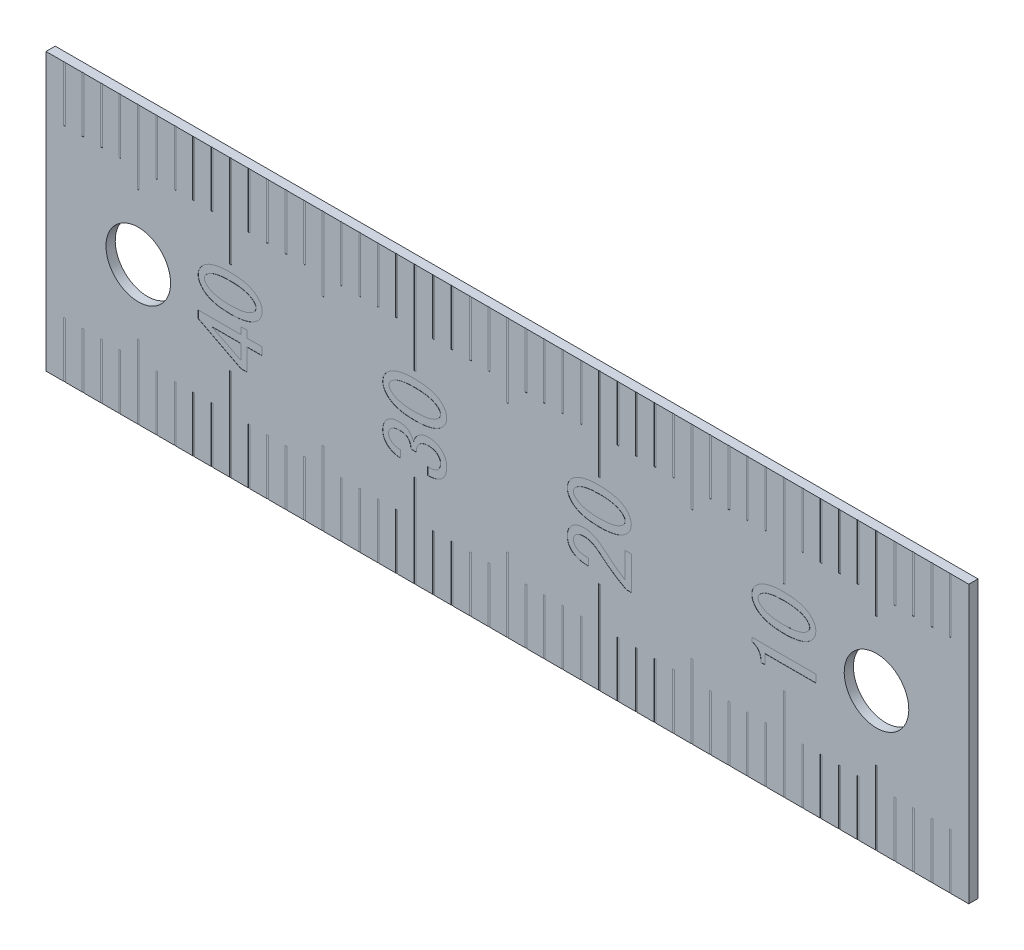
from build123d import *

# Parameters (mm, degrees)
SKETCH1_W             = 15
SKETCH1_H             = 50
EXTRUDE1_DEPTH        = 0.5
SKETCH2_R             = 1.75
EXTRUDE2_DEPTH        = 53.203927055
EXTRUDE3_DEPTH        = 0.01
SKETCH4_W             = 5
SKETCH4_H             = 0.1
SKETCH4_W_2           = 3
SKETCH4_W_3           = 4
EXTRUDE4_DEPTH        = 0.01
BODY_MOVE_COPY2_ANGLE = 90


with BuildPart() as part:
    # Sketch1 → Extrude1 (new body)
    with BuildSketch(Plane.XY):
        with Locations((7.5, 25)):
            Rectangle(SKETCH1_W, SKETCH1_H)
    extrude(amount=EXTRUDE1_DEPTH)

    # Sketch2 → Extrude2 (cut, through all)
    with BuildSketch(Plane.XY.offset(0.5)):
        with Locations((7.5, 5)):
            Circle(SKETCH2_R)
        with Locations((7.5, 45)):
            Circle(SKETCH2_R)
    extrude(amount=-EXTRUDE2_DEPTH, mode=Mode.SUBTRACT)

    # Sketch3 → Extrude3 (cut)
    # profile 1 of 8: a face of its own
    with BuildSketch(Plane.XY.offset(0.5)):
        Polygon((6.572881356, 38.286911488), (6.572881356, 38.694915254), (6.572881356, 39.105555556), (5.392372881, 39.105555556), (5.392372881, 39.442372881), (6.584745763, 41.755932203), (6.994067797, 41.755932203), (6.994067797, 39.442372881), (7.36779661, 39.442372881), (7.36779661, 39.105555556), (6.994067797, 39.105555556), (6.994067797, 38.286911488), align=None)
        Polygon((6.572881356, 39.442372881), (6.572881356, 41.008474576), (5.783898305, 39.442372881), align=None, mode=Mode.SUBTRACT)
    # profile 2 of 8: a face of its own
    with BuildSketch(Plane.XY.offset(0.5)):
        with BuildLine():
            add(Edge.make_bspline(
                [(7.670338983, 40.029661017), (7.670829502, 40.072507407), (7.671793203, 40.156685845), (7.676090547, 40.280686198), (7.684705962, 40.399825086), (7.696795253, 40.514071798), (7.710795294, 40.623684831), (7.729370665, 40.728309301), (7.751095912, 40.828149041), (7.77597959, 40.922993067), (7.804365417, 41.012966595), (7.836057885, 41.098089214), (7.870573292, 41.178755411), (7.909950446, 41.253817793), (7.951116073, 41.324637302), (7.996213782, 41.390336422), (8.044897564, 41.450979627), (8.080073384, 41.488323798), (8.097457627, 41.506779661)],
                knots=[0, 0, 0, 0, 1.305427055, 2.564715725, 3.779397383, 4.943659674, 6.064530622, 7.145206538, 8.1798118, 9.17670212, 10.131464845, 11.052792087, 11.943155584, 12.802378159, 13.633530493, 14.437472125, 15.227783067, 16, 16, 16, 16], degree=3))
            add(Edge.make_bspline(
                [(8.097457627, 41.506779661), (8.118189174, 41.526742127), (8.158560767, 41.565616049), (8.223990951, 41.6159742), (8.29062965, 41.658865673), (8.358609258, 41.695138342), (8.429073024, 41.722269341), (8.501187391, 41.741138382), (8.574673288, 41.753722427), (8.624274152, 41.755194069), (8.649152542, 41.755932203)],
                knots=[0, 0, 0, 0, 1.110117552, 2.161788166, 3.18031983, 4.16653166, 5.130321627, 6.086809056, 7.040397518, 8, 8, 8, 8], degree=3))
            add(Edge.make_bspline(
                [(8.649152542, 41.755932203), (8.674030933, 41.755194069), (8.723631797, 41.753722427), (8.797117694, 41.741138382), (8.869232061, 41.722269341), (8.939695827, 41.695138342), (9.007675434, 41.658865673), (9.074314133, 41.6159742), (9.139744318, 41.565616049), (9.18011591, 41.526742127), (9.200847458, 41.506779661)],
                knots=[0, 0, 0, 0, 0.959602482, 1.913190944, 2.869678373, 3.83346834, 4.81968017, 5.838211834, 6.889882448, 8, 8, 8, 8], degree=3))
            add(Edge.make_bspline(
                [(9.200847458, 41.506779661), (9.218227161, 41.488321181), (9.253393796, 41.450971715), (9.302148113, 41.39036917), (9.347032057, 41.324417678), (9.389280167, 41.254207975), (9.427522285, 41.17853116), (9.462317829, 41.098126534), (9.493918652, 41.012955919), (9.522335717, 40.922996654), (9.547189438, 40.828145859), (9.569006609, 40.728318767), (9.587229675, 40.623619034), (9.602638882, 40.514179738), (9.613279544, 40.399768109), (9.622305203, 40.280696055), (9.626487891, 40.156683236), (9.62746749, 40.072506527), (9.627966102, 40.029661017)],
                knots=[0, 0, 0, 0, 0.772188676, 1.562470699, 2.366382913, 3.20092084, 4.057056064, 4.947386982, 5.868680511, 6.823408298, 7.82026214, 8.854829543, 9.935465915, 11.057194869, 12.220740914, 13.435378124, 14.694620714, 16, 16, 16, 16], degree=3))
            add(Edge.make_bspline(
                [(9.627966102, 40.029661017), (9.627467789, 39.985936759), (9.62649093, 39.900222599), (9.622328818, 39.774232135), (9.613247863, 39.653405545), (9.602616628, 39.537241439), (9.587362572, 39.426237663), (9.568912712, 39.320259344), (9.547201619, 39.219315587), (9.522309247, 39.123160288), (9.494041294, 39.032051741), (9.462303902, 38.946046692), (9.427521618, 38.864982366), (9.389289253, 38.788641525), (9.347004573, 38.717800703), (9.302346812, 38.651238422), (9.253373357, 38.590568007), (9.218220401, 38.553208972), (9.200847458, 38.534745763)],
                knots=[0, 0, 0, 0, 1.317726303, 2.583183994, 3.797878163, 4.968595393, 6.097857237, 7.173314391, 8.20962062, 9.208490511, 10.165515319, 11.083041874, 11.969809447, 12.822581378, 13.653772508, 14.454446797, 15.23617212, 16, 16, 16, 16], degree=3))
            add(Edge.make_bspline(
                [(9.200847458, 38.534745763), (9.180085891, 38.515033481), (9.139553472, 38.476549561), (9.074305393, 38.426244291), (9.007859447, 38.383179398), (8.939507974, 38.347848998), (8.869256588, 38.320526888), (8.797111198, 38.30171788), (8.723633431, 38.289118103), (8.674031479, 38.287648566), (8.649152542, 38.286911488)],
                knots=[0, 0, 0, 0, 1.105704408, 2.15864601, 3.178408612, 4.161898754, 5.126853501, 6.084496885, 7.039237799, 8, 8, 8, 8], degree=3))
            add(Edge.make_bspline(
                [(8.649152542, 38.286911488), (8.624273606, 38.287648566), (8.574671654, 38.289118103), (8.501193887, 38.30171788), (8.429048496, 38.320526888), (8.358797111, 38.347848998), (8.290445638, 38.383179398), (8.223999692, 38.426244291), (8.158751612, 38.476549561), (8.118219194, 38.515033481), (8.097457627, 38.534745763)],
                knots=[0, 0, 0, 0, 0.960762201, 1.915503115, 2.873146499, 3.838101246, 4.821591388, 5.84135399, 6.894295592, 8, 8, 8, 8], degree=3))
            add(Edge.make_bspline(
                [(8.097457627, 38.534745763), (8.080080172, 38.553206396), (8.044918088, 38.590560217), (7.996014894, 38.65127076), (7.951141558, 38.717581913), (7.909944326, 38.789029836), (7.870572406, 38.864759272), (7.836072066, 38.946083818), (7.804242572, 39.032041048), (7.77600611, 39.123163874), (7.751083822, 39.219312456), (7.729463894, 39.320268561), (7.71066559, 39.426173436), (7.696818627, 39.537347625), (7.684739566, 39.65334975), (7.67606663, 39.77424179), (7.671790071, 39.900220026), (7.67082916, 39.98593589), (7.670338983, 40.029661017)],
                knots=[0, 0, 0, 0, 0.763855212, 1.545608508, 2.346311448, 3.174176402, 4.029980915, 4.916780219, 5.834339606, 6.79139866, 7.790304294, 8.826647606, 9.902143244, 11.030571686, 12.201985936, 13.416723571, 14.682226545, 16, 16, 16, 16], degree=3))
        make_face()
        with BuildLine():
            add(Edge.make_bspline(
                [(9.218644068, 40.029661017), (9.218401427, 40.06811401), (9.217925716, 40.143502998), (9.213890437, 40.254274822), (9.207394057, 40.36043931), (9.19820924, 40.461995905), (9.186467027, 40.558736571), (9.171997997, 40.650645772), (9.154788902, 40.737919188), (9.135417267, 40.820493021), (9.112729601, 40.898295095), (9.087786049, 40.971360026), (9.060527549, 41.040128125), (9.029099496, 41.103353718), (8.996371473, 41.162419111), (8.960630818, 41.216569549), (8.922584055, 41.266432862), (8.894393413, 41.296304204), (8.880508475, 41.311016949)],
                knots=[0, 0, 0, 0, 1.361121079, 2.668545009, 3.923107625, 5.125754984, 6.277561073, 7.372066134, 8.418398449, 9.425734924, 10.373324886, 11.2857946, 12.158104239, 12.989405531, 13.783340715, 14.546945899, 15.284316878, 16, 16, 16, 16], degree=3))
            add(Edge.make_bspline(
                [(8.880508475, 41.311016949), (8.862804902, 41.327301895), (8.828895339, 41.358494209), (8.771271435, 41.392758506), (8.711034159, 41.414027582), (8.669751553, 41.416541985), (8.649152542, 41.41779661)],
                knots=[0, 0, 0, 0, 1.101426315, 2.109680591, 3.056776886, 4, 4, 4, 4], degree=3))
            add(Edge.make_bspline(
                [(8.649152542, 41.41779661), (8.628553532, 41.416541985), (8.587270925, 41.414027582), (8.52703365, 41.392758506), (8.469409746, 41.358494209), (8.435500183, 41.327301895), (8.41779661, 41.311016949)],
                knots=[0, 0, 0, 0, 0.943223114, 1.890319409, 2.898573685, 4, 4, 4, 4], degree=3))
            add(Edge.make_bspline(
                [(8.41779661, 41.311016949), (8.403943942, 41.295612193), (8.375924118, 41.264452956), (8.337429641, 41.213183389), (8.302154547, 41.157195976), (8.269141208, 41.096778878), (8.238105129, 41.032500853), (8.210344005, 40.963298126), (8.185591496, 40.889711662), (8.163077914, 40.811655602), (8.143495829, 40.72935949), (8.126232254, 40.642529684), (8.111958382, 40.551250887), (8.100069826, 40.455410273), (8.090947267, 40.355384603), (8.084385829, 40.25076225), (8.080392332, 40.141745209), (8.07990761, 40.067454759), (8.079661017, 40.029661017)],
                knots=[0, 0, 0, 0, 0.733849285, 1.48435867, 2.268363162, 3.076728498, 3.92289974, 4.796109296, 5.716889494, 6.672935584, 7.673739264, 8.713513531, 9.809147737, 10.946688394, 12.135070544, 13.36761715, 14.660829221, 16, 16, 16, 16], degree=3))
            add(Edge.make_bspline(
                [(8.079661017, 40.029661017), (8.079901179, 39.99032918), (8.080370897, 39.913402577), (8.084420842, 39.800434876), (8.090885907, 39.692511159), (8.100090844, 39.589417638), (8.111903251, 39.491150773), (8.126256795, 39.397688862), (8.14342239, 39.309080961), (8.163018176, 39.225467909), (8.185450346, 39.146714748), (8.21053616, 39.072812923), (8.237777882, 39.003387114), (8.269201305, 38.93949489), (8.301960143, 38.879799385), (8.3374802, 38.825046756), (8.375740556, 38.775105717), (8.403918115, 38.745225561), (8.41779661, 38.730508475)],
                knots=[0, 0, 0, 0, 1.374671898, 2.688632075, 3.950368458, 5.153146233, 6.305673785, 7.409137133, 8.457347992, 9.459453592, 10.409852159, 11.318084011, 12.186518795, 13.014240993, 13.804868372, 14.565269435, 15.2933419, 16, 16, 16, 16], degree=3))
            add(Edge.make_bspline(
                [(8.41779661, 38.730508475), (8.43545363, 38.714135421), (8.469192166, 38.68285025), (8.527371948, 38.649736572), (8.587110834, 38.627272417), (8.628524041, 38.624907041), (8.649152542, 38.623728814)],
                knots=[0, 0, 0, 0, 1.101932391, 2.105541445, 3.0563435, 4, 4, 4, 4], degree=3))
            add(Edge.make_bspline(
                [(8.649152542, 38.623728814), (8.669781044, 38.624907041), (8.711194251, 38.627272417), (8.770933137, 38.649736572), (8.829112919, 38.68285025), (8.862851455, 38.714135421), (8.880508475, 38.730508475)],
                knots=[0, 0, 0, 0, 0.9436565, 1.894458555, 2.898067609, 4, 4, 4, 4], degree=3))
            add(Edge.make_bspline(
                [(8.880508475, 38.730508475), (8.894386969, 38.745225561), (8.922564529, 38.775105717), (8.960824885, 38.825046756), (8.996344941, 38.879799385), (9.02910378, 38.93949489), (9.060527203, 39.003387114), (9.087768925, 39.072812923), (9.112854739, 39.146714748), (9.135286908, 39.225467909), (9.154882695, 39.309080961), (9.17204829, 39.397688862), (9.186401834, 39.491150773), (9.198214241, 39.589417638), (9.207419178, 39.692511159), (9.213884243, 39.800434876), (9.217934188, 39.913402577), (9.218403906, 39.99032918), (9.218644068, 40.029661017)],
                knots=[0, 0, 0, 0, 0.7066581, 1.434730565, 2.195131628, 2.985759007, 3.813481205, 4.681915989, 5.590147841, 6.540546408, 7.542652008, 8.590862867, 9.694326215, 10.846853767, 12.049631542, 13.311367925, 14.625328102, 16, 16, 16, 16], degree=3))
        make_face(mode=Mode.SUBTRACT)
    # profile 3 of 8: a face of its own
    with BuildSketch(Plane.XY.offset(0.5)):
        with BuildLine():
            add(Edge.make_bspline(
                [(5.855084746, 29.31779661), (5.854237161, 29.286380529), (5.852594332, 29.225488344), (5.856876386, 29.137276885), (5.868367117, 29.055815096), (5.884283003, 28.980780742), (5.907291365, 28.912297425), (5.937126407, 28.851010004), (5.972049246, 28.795439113), (6.000912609, 28.763950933), (6.015254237, 28.748305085)],
                knots=[0, 0, 0, 0, 1.239207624, 2.401892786, 3.477811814, 4.480626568, 5.423235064, 6.318453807, 7.164473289, 8, 8, 8, 8], degree=3))
            add(Edge.make_bspline(
                [(6.015254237, 28.748305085), (6.037095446, 28.728932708), (6.081015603, 28.689977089), (6.162748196, 28.65151788), (6.254479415, 28.62775036), (6.319389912, 28.625111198), (6.353389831, 28.623728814)],
                knots=[0, 0, 0, 0, 0.943344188, 1.896956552, 2.898432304, 4, 4, 4, 4], degree=3))
            add(Edge.make_bspline(
                [(6.353389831, 28.623728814), (6.382885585, 28.625600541), (6.442770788, 28.629400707), (6.530035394, 28.662470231), (6.615193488, 28.713031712), (6.665308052, 28.759558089), (6.691525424, 28.783898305)],
                knots=[0, 0, 0, 0, 0.919697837, 1.867261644, 2.884260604, 4, 4, 4, 4], degree=3))
            add(Edge.make_bspline(
                [(6.691525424, 28.783898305), (6.704506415, 28.798041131), (6.730947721, 28.826849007), (6.762873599, 28.87803764), (6.790850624, 28.93489513), (6.812875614, 28.998785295), (6.830852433, 29.069052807), (6.842953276, 29.14607081), (6.850175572, 29.229773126), (6.851175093, 29.287680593), (6.851694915, 29.31779661)],
                knots=[0, 0, 0, 0, 0.805009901, 1.639744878, 2.523230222, 3.463349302, 4.47308559, 5.567268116, 6.734805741, 8, 8, 8, 8], degree=3))
            add(Edge.make_bspline(
                [(6.851694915, 29.31779661), (6.851030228, 29.341116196), (6.849720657, 29.387060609), (6.840325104, 29.454392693), (6.825098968, 29.518830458), (6.80407704, 29.580614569), (6.776099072, 29.639452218), (6.742223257, 29.695639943), (6.702890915, 29.749647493), (6.671713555, 29.781952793), (6.655932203, 29.798305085)],
                knots=[0, 0, 0, 0, 1.049658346, 2.068044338, 3.05411714, 4.026954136, 5.00039438, 5.980894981, 6.977969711, 8, 8, 8, 8], degree=3))
            add(Edge.make_bspline(
                [(6.655932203, 29.798305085), (6.643689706, 29.809635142), (6.618997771, 29.832486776), (6.576319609, 29.860786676), (6.529139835, 29.884057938), (6.477383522, 29.901482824), (6.421623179, 29.914983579), (6.361288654, 29.922371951), (6.296502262, 29.92600955), (6.251882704, 29.923947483), (6.228813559, 29.922881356)],
                knots=[0, 0, 0, 0, 0.871605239, 1.757943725, 2.667896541, 3.616736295, 4.609341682, 5.664478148, 6.79249158, 8, 8, 8, 8], degree=3))
            Line((6.228813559, 29.922881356), (6.228813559, 30.225423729))
            add(Edge.make_bspline(
                [(6.228813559, 30.225423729), (6.251905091, 30.227382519), (6.296701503, 30.231182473), (6.361634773, 30.240642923), (6.421607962, 30.255530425), (6.477699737, 30.27292487), (6.528907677, 30.295554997), (6.57613528, 30.321174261), (6.618876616, 30.350763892), (6.643673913, 30.374071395), (6.655932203, 30.38559322)],
                knots=[0, 0, 0, 0, 1.193010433, 2.314380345, 3.373317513, 4.371301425, 5.333718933, 6.249965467, 7.134888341, 8, 8, 8, 8], degree=3))
            add(Edge.make_bspline(
                [(6.655932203, 30.38559322), (6.667527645, 30.397801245), (6.691022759, 30.422537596), (6.719260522, 30.465783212), (6.744475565, 30.512503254), (6.7636149, 30.564151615), (6.779886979, 30.620003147), (6.790583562, 30.680329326), (6.797465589, 30.745099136), (6.798018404, 30.789622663), (6.798305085, 30.812711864)],
                knots=[0, 0, 0, 0, 0.872621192, 1.768137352, 2.671468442, 3.624922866, 4.621628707, 5.689026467, 6.801565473, 8, 8, 8, 8], degree=3))
            add(Edge.make_bspline(
                [(6.798305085, 30.812711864), (6.797772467, 30.841289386), (6.796742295, 30.896563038), (6.789606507, 30.97655192), (6.777306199, 31.050680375), (6.759528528, 31.118580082), (6.737339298, 31.180667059), (6.709321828, 31.236148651), (6.677557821, 31.286558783), (6.651119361, 31.314896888), (6.638135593, 31.328813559)],
                knots=[0, 0, 0, 0, 1.237773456, 2.394058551, 3.475172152, 4.488524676, 5.430883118, 6.32465486, 7.177248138, 8, 8, 8, 8], degree=3))
            add(Edge.make_bspline(
                [(6.638135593, 31.328813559), (6.619858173, 31.345254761), (6.583764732, 31.377722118), (6.518584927, 31.411756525), (6.44688644, 31.432032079), (6.396808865, 31.434387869), (6.371186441, 31.43559322)],
                knots=[0, 0, 0, 0, 0.996207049, 1.967265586, 2.959941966, 4, 4, 4, 4], degree=3))
            add(Edge.make_bspline(
                [(6.371186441, 31.43559322), (6.345564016, 31.434387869), (6.295486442, 31.432032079), (6.223787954, 31.411756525), (6.158608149, 31.377722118), (6.122514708, 31.345254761), (6.104237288, 31.328813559)],
                knots=[0, 0, 0, 0, 1.040058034, 2.032734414, 3.003792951, 4, 4, 4, 4], degree=3))
            add(Edge.make_bspline(
                [(6.104237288, 31.328813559), (6.089776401, 31.313325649), (6.060656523, 31.282137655), (6.023858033, 31.228720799), (5.99197489, 31.170117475), (5.965103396, 31.105788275), (5.942469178, 31.036012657), (5.926581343, 30.960375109), (5.914425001, 30.879600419), (5.910499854, 30.823738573), (5.908474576, 30.794915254)],
                knots=[0, 0, 0, 0, 0.873425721, 1.758816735, 2.667665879, 3.622477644, 4.631783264, 5.6899558, 6.808074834, 8, 8, 8, 8], degree=3))
            Line((5.908474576, 30.794915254), (5.516949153, 30.794915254))
            add(Edge.make_bspline(
                [(5.516949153, 30.794915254), (5.519136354, 30.832553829), (5.523428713, 30.906419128), (5.541152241, 31.014153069), (5.565742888, 31.116659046), (5.599421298, 31.213425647), (5.641988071, 31.304205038), (5.692307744, 31.389733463), (5.750770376, 31.470197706), (5.796519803, 31.518246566), (5.819491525, 31.542372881)],
                knots=[0, 0, 0, 0, 1.094560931, 2.148064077, 3.166651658, 4.153716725, 5.118829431, 6.07444051, 7.0331372, 8, 8, 8, 8], degree=3))
            add(Edge.make_bspline(
                [(5.819491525, 31.542372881), (5.837606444, 31.559463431), (5.873568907, 31.593392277), (5.933236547, 31.637089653), (5.997087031, 31.673081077), (6.063953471, 31.704293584), (6.135510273, 31.726605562), (6.210503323, 31.744361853), (6.289639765, 31.75403117), (6.343699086, 31.755291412), (6.371186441, 31.755932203)],
                knots=[0, 0, 0, 0, 0.982869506, 1.951232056, 2.911200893, 3.87414517, 4.85919522, 5.865267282, 6.914559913, 8, 8, 8, 8], degree=3))
            add(Edge.make_bspline(
                [(6.371186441, 31.755932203), (6.400212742, 31.75530941), (6.45690343, 31.754093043), (6.539734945, 31.744312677), (6.617668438, 31.726841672), (6.691695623, 31.704105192), (6.760787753, 31.673425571), (6.826107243, 31.637226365), (6.886527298, 31.593587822), (6.922581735, 31.559488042), (6.940677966, 31.542372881)],
                knots=[0, 0, 0, 0, 1.1148228, 2.177338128, 3.197095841, 4.179355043, 5.146818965, 6.095248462, 7.043978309, 8, 8, 8, 8], degree=3))
            add(Edge.make_bspline(
                [(6.940677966, 31.542372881), (6.960789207, 31.521311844), (7.000715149, 31.479500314), (7.050703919, 31.408467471), (7.093629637, 31.333157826), (7.129597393, 31.253229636), (7.156749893, 31.167830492), (7.175324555, 31.077438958), (7.187735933, 30.982230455), (7.189122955, 30.917115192), (7.189830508, 30.883898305)],
                knots=[0, 0, 0, 0, 0.965213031, 1.916194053, 2.872998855, 3.839092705, 4.81906353, 5.840080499, 6.898172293, 8, 8, 8, 8], degree=3))
            add(Edge.make_bspline(
                [(7.189830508, 30.883898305), (7.189188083, 30.853553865), (7.187942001, 30.794696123), (7.178630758, 30.709388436), (7.163534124, 30.62978595), (7.142688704, 30.555442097), (7.114814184, 30.48659326), (7.081194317, 30.423115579), (7.041799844, 30.364749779), (7.009934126, 30.331141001), (6.994067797, 30.31440678)],
                knots=[0, 0, 0, 0, 1.177909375, 2.284737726, 3.326967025, 4.320553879, 5.277281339, 6.204541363, 7.106019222, 8, 8, 8, 8], degree=3))
            add(Edge.make_bspline(
                [(6.994067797, 30.31440678), (6.965346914, 30.286806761), (6.910623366, 30.23421886), (6.82464357, 30.168038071), (6.741089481, 30.116155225), (6.683328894, 30.093701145), (6.655932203, 30.083050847)],
                knots=[0, 0, 0, 0, 1.156237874, 2.20304646, 3.147678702, 4, 4, 4, 4], degree=3))
            add(Edge.make_bspline(
                [(6.655932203, 30.083050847), (6.692456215, 30.070797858), (6.762638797, 30.04725317), (6.859251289, 30.002078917), (6.942516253, 29.949298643), (6.989290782, 29.907473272), (7.011864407, 29.887288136)],
                knots=[0, 0, 0, 0, 1.127022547, 2.165626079, 3.114721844, 4, 4, 4, 4], degree=3))
            add(Edge.make_bspline(
                [(7.011864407, 29.887288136), (7.031906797, 29.866396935), (7.071315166, 29.82531959), (7.121385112, 29.75713319), (7.164478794, 29.686384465), (7.200684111, 29.612307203), (7.227428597, 29.534251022), (7.246538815, 29.452987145), (7.258829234, 29.368703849), (7.26028238, 29.311247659), (7.261016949, 29.28220339)],
                knots=[0, 0, 0, 0, 1.032403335, 2.029964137, 3.011802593, 3.986915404, 4.966590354, 5.950024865, 6.963731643, 8, 8, 8, 8], degree=3))
            add(Edge.make_bspline(
                [(7.261016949, 29.28220339), (7.260107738, 29.244595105), (7.258326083, 29.170899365), (7.245030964, 29.062972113), (7.222782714, 28.960785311), (7.191569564, 28.864018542), (7.151384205, 28.772986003), (7.102175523, 28.687259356), (7.044331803, 28.606956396), (6.999018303, 28.558879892), (6.976271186, 28.534745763)],
                knots=[0, 0, 0, 0, 1.098385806, 2.152354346, 3.170785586, 4.14905217, 5.117394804, 6.071856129, 7.032082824, 8, 8, 8, 8], degree=3))
            add(Edge.make_bspline(
                [(6.976271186, 28.534745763), (6.95539303, 28.51489658), (6.913980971, 28.475525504), (6.844715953, 28.425961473), (6.772751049, 28.382434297), (6.69643541, 28.347443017), (6.616257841, 28.320218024), (6.532036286, 28.301445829), (6.444059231, 28.289024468), (6.383973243, 28.287624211), (6.353389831, 28.286911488)],
                knots=[0, 0, 0, 0, 1.002941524, 1.989345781, 2.961196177, 3.930871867, 4.909217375, 5.906794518, 6.934570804, 8, 8, 8, 8], degree=3))
            add(Edge.make_bspline(
                [(6.353389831, 28.286911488), (6.320174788, 28.287384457), (6.255300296, 28.288308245), (6.161021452, 28.300136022), (6.072206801, 28.31739535), (5.989040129, 28.342792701), (5.911092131, 28.374810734), (5.838829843, 28.414630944), (5.772044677, 28.461543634), (5.732521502, 28.498450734), (5.712711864, 28.516949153)],
                knots=[0, 0, 0, 0, 1.139704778, 2.226032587, 3.257187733, 4.242744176, 5.206582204, 6.145174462, 7.070332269, 8, 8, 8, 8], degree=3))
            add(Edge.make_bspline(
                [(5.712711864, 28.516949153), (5.691201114, 28.540157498), (5.64795465, 28.586816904), (5.593991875, 28.667318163), (5.547688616, 28.755199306), (5.509997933, 28.851612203), (5.481332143, 28.9564097), (5.460323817, 29.069484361), (5.447736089, 29.190956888), (5.44643317, 29.27470259), (5.445762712, 29.31779661)],
                knots=[0, 0, 0, 0, 0.875500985, 1.760158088, 2.674977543, 3.623303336, 4.621607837, 5.680513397, 6.806434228, 8, 8, 8, 8], degree=3))
            Line((5.445762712, 29.31779661), (5.855084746, 29.31779661))
        make_face()
    # profile 4 of 8: a face of its own
    with BuildSketch(Plane.XY.offset(0.5)):
        with BuildLine():
            add(Edge.make_bspline(
                [(7.670338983, 30.029661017), (7.670829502, 30.072507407), (7.671793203, 30.156685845), (7.676090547, 30.280686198), (7.684705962, 30.399825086), (7.696795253, 30.514071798), (7.710795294, 30.623684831), (7.729370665, 30.728309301), (7.751095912, 30.828149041), (7.77597959, 30.922993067), (7.804365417, 31.012966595), (7.836057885, 31.098089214), (7.870573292, 31.178755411), (7.909950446, 31.253817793), (7.951116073, 31.324637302), (7.996213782, 31.390336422), (8.044897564, 31.450979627), (8.080073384, 31.488323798), (8.097457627, 31.506779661)],
                knots=[0, 0, 0, 0, 1.305427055, 2.564715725, 3.779397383, 4.943659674, 6.064530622, 7.145206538, 8.1798118, 9.17670212, 10.131464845, 11.052792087, 11.943155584, 12.802378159, 13.633530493, 14.437472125, 15.227783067, 16, 16, 16, 16], degree=3))
            add(Edge.make_bspline(
                [(8.097457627, 31.506779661), (8.118189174, 31.526742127), (8.158560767, 31.565616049), (8.223990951, 31.6159742), (8.29062965, 31.658865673), (8.358609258, 31.695138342), (8.429073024, 31.722269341), (8.501187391, 31.741138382), (8.574673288, 31.753722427), (8.624274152, 31.755194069), (8.649152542, 31.755932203)],
                knots=[0, 0, 0, 0, 1.110117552, 2.161788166, 3.18031983, 4.16653166, 5.130321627, 6.086809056, 7.040397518, 8, 8, 8, 8], degree=3))
            add(Edge.make_bspline(
                [(8.649152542, 31.755932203), (8.674030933, 31.755194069), (8.723631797, 31.753722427), (8.797117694, 31.741138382), (8.869232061, 31.722269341), (8.939695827, 31.695138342), (9.007675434, 31.658865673), (9.074314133, 31.6159742), (9.139744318, 31.565616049), (9.18011591, 31.526742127), (9.200847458, 31.506779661)],
                knots=[0, 0, 0, 0, 0.959602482, 1.913190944, 2.869678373, 3.83346834, 4.81968017, 5.838211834, 6.889882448, 8, 8, 8, 8], degree=3))
            add(Edge.make_bspline(
                [(9.200847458, 31.506779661), (9.218227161, 31.488321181), (9.253393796, 31.450971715), (9.302148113, 31.39036917), (9.347032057, 31.324417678), (9.389280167, 31.254207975), (9.427522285, 31.17853116), (9.462317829, 31.098126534), (9.493918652, 31.012955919), (9.522335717, 30.922996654), (9.547189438, 30.828145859), (9.569006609, 30.728318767), (9.587229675, 30.623619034), (9.602638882, 30.514179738), (9.613279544, 30.399768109), (9.622305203, 30.280696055), (9.626487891, 30.156683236), (9.62746749, 30.072506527), (9.627966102, 30.029661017)],
                knots=[0, 0, 0, 0, 0.772188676, 1.562470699, 2.366382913, 3.20092084, 4.057056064, 4.947386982, 5.868680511, 6.823408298, 7.82026214, 8.854829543, 9.935465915, 11.057194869, 12.220740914, 13.435378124, 14.694620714, 16, 16, 16, 16], degree=3))
            add(Edge.make_bspline(
                [(9.627966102, 30.029661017), (9.627467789, 29.985936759), (9.62649093, 29.900222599), (9.622328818, 29.774232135), (9.613247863, 29.653405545), (9.602616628, 29.537241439), (9.587362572, 29.426237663), (9.568912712, 29.320259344), (9.547201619, 29.219315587), (9.522309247, 29.123160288), (9.494041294, 29.032051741), (9.462303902, 28.946046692), (9.427521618, 28.864982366), (9.389289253, 28.788641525), (9.347004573, 28.717800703), (9.302346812, 28.651238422), (9.253373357, 28.590568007), (9.218220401, 28.553208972), (9.200847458, 28.534745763)],
                knots=[0, 0, 0, 0, 1.317726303, 2.583183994, 3.797878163, 4.968595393, 6.097857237, 7.173314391, 8.20962062, 9.208490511, 10.165515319, 11.083041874, 11.969809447, 12.822581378, 13.653772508, 14.454446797, 15.23617212, 16, 16, 16, 16], degree=3))
            add(Edge.make_bspline(
                [(9.200847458, 28.534745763), (9.180085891, 28.515033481), (9.139553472, 28.476549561), (9.074305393, 28.426244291), (9.007859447, 28.383179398), (8.939507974, 28.347848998), (8.869256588, 28.320526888), (8.797111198, 28.30171788), (8.723633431, 28.289118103), (8.674031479, 28.287648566), (8.649152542, 28.286911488)],
                knots=[0, 0, 0, 0, 1.105704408, 2.15864601, 3.178408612, 4.161898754, 5.126853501, 6.084496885, 7.039237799, 8, 8, 8, 8], degree=3))
            add(Edge.make_bspline(
                [(8.649152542, 28.286911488), (8.624273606, 28.287648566), (8.574671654, 28.289118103), (8.501193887, 28.30171788), (8.429048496, 28.320526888), (8.358797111, 28.347848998), (8.290445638, 28.383179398), (8.223999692, 28.426244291), (8.158751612, 28.476549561), (8.118219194, 28.515033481), (8.097457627, 28.534745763)],
                knots=[0, 0, 0, 0, 0.960762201, 1.915503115, 2.873146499, 3.838101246, 4.821591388, 5.84135399, 6.894295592, 8, 8, 8, 8], degree=3))
            add(Edge.make_bspline(
                [(8.097457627, 28.534745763), (8.080080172, 28.553206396), (8.044918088, 28.590560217), (7.996014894, 28.65127076), (7.951141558, 28.717581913), (7.909944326, 28.789029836), (7.870572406, 28.864759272), (7.836072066, 28.946083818), (7.804242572, 29.032041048), (7.77600611, 29.123163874), (7.751083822, 29.219312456), (7.729463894, 29.320268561), (7.71066559, 29.426173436), (7.696818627, 29.537347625), (7.684739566, 29.65334975), (7.67606663, 29.77424179), (7.671790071, 29.900220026), (7.67082916, 29.98593589), (7.670338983, 30.029661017)],
                knots=[0, 0, 0, 0, 0.763855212, 1.545608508, 2.346311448, 3.174176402, 4.029980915, 4.916780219, 5.834339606, 6.79139866, 7.790304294, 8.826647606, 9.902143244, 11.030571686, 12.201985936, 13.416723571, 14.682226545, 16, 16, 16, 16], degree=3))
        make_face()
        with BuildLine():
            add(Edge.make_bspline(
                [(9.218644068, 30.029661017), (9.218401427, 30.06811401), (9.217925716, 30.143502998), (9.213890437, 30.254274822), (9.207394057, 30.36043931), (9.19820924, 30.461995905), (9.186467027, 30.558736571), (9.171997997, 30.650645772), (9.154788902, 30.737919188), (9.135417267, 30.820493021), (9.112729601, 30.898295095), (9.087786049, 30.971360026), (9.060527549, 31.040128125), (9.029099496, 31.103353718), (8.996371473, 31.162419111), (8.960630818, 31.216569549), (8.922584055, 31.266432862), (8.894393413, 31.296304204), (8.880508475, 31.311016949)],
                knots=[0, 0, 0, 0, 1.361121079, 2.668545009, 3.923107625, 5.125754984, 6.277561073, 7.372066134, 8.418398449, 9.425734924, 10.373324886, 11.2857946, 12.158104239, 12.989405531, 13.783340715, 14.546945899, 15.284316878, 16, 16, 16, 16], degree=3))
            add(Edge.make_bspline(
                [(8.880508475, 31.311016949), (8.862804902, 31.327301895), (8.828895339, 31.358494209), (8.771271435, 31.392758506), (8.711034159, 31.414027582), (8.669751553, 31.416541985), (8.649152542, 31.41779661)],
                knots=[0, 0, 0, 0, 1.101426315, 2.109680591, 3.056776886, 4, 4, 4, 4], degree=3))
            add(Edge.make_bspline(
                [(8.649152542, 31.41779661), (8.628553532, 31.416541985), (8.587270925, 31.414027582), (8.52703365, 31.392758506), (8.469409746, 31.358494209), (8.435500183, 31.327301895), (8.41779661, 31.311016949)],
                knots=[0, 0, 0, 0, 0.943223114, 1.890319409, 2.898573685, 4, 4, 4, 4], degree=3))
            add(Edge.make_bspline(
                [(8.41779661, 31.311016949), (8.403943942, 31.295612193), (8.375924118, 31.264452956), (8.337429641, 31.213183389), (8.302154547, 31.157195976), (8.269141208, 31.096778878), (8.238105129, 31.032500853), (8.210344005, 30.963298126), (8.185591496, 30.889711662), (8.163077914, 30.811655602), (8.143495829, 30.72935949), (8.126232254, 30.642529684), (8.111958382, 30.551250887), (8.100069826, 30.455410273), (8.090947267, 30.355384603), (8.084385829, 30.25076225), (8.080392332, 30.141745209), (8.07990761, 30.067454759), (8.079661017, 30.029661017)],
                knots=[0, 0, 0, 0, 0.733849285, 1.48435867, 2.268363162, 3.076728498, 3.92289974, 4.796109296, 5.716889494, 6.672935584, 7.673739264, 8.713513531, 9.809147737, 10.946688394, 12.135070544, 13.36761715, 14.660829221, 16, 16, 16, 16], degree=3))
            add(Edge.make_bspline(
                [(8.079661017, 30.029661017), (8.079901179, 29.99032918), (8.080370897, 29.913402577), (8.084420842, 29.800434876), (8.090885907, 29.692511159), (8.100090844, 29.589417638), (8.111903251, 29.491150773), (8.126256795, 29.397688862), (8.14342239, 29.309080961), (8.163018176, 29.225467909), (8.185450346, 29.146714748), (8.21053616, 29.072812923), (8.237777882, 29.003387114), (8.269201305, 28.93949489), (8.301960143, 28.879799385), (8.3374802, 28.825046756), (8.375740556, 28.775105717), (8.403918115, 28.745225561), (8.41779661, 28.730508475)],
                knots=[0, 0, 0, 0, 1.374671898, 2.688632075, 3.950368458, 5.153146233, 6.305673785, 7.409137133, 8.457347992, 9.459453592, 10.409852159, 11.318084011, 12.186518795, 13.014240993, 13.804868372, 14.565269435, 15.2933419, 16, 16, 16, 16], degree=3))
            add(Edge.make_bspline(
                [(8.41779661, 28.730508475), (8.43545363, 28.714135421), (8.469192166, 28.68285025), (8.527371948, 28.649736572), (8.587110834, 28.627272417), (8.628524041, 28.624907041), (8.649152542, 28.623728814)],
                knots=[0, 0, 0, 0, 1.101932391, 2.105541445, 3.0563435, 4, 4, 4, 4], degree=3))
            add(Edge.make_bspline(
                [(8.649152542, 28.623728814), (8.669781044, 28.624907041), (8.711194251, 28.627272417), (8.770933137, 28.649736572), (8.829112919, 28.68285025), (8.862851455, 28.714135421), (8.880508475, 28.730508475)],
                knots=[0, 0, 0, 0, 0.9436565, 1.894458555, 2.898067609, 4, 4, 4, 4], degree=3))
            add(Edge.make_bspline(
                [(8.880508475, 28.730508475), (8.894386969, 28.745225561), (8.922564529, 28.775105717), (8.960824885, 28.825046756), (8.996344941, 28.879799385), (9.02910378, 28.93949489), (9.060527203, 29.003387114), (9.087768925, 29.072812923), (9.112854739, 29.146714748), (9.135286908, 29.225467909), (9.154882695, 29.309080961), (9.17204829, 29.397688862), (9.186401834, 29.491150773), (9.198214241, 29.589417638), (9.207419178, 29.692511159), (9.213884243, 29.800434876), (9.217934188, 29.913402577), (9.218403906, 29.99032918), (9.218644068, 30.029661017)],
                knots=[0, 0, 0, 0, 0.7066581, 1.434730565, 2.195131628, 2.985759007, 3.813481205, 4.681915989, 5.590147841, 6.540546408, 7.542652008, 8.590862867, 9.694326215, 10.846853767, 12.049631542, 13.311367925, 14.625328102, 16, 16, 16, 16], degree=3))
        make_face(mode=Mode.SUBTRACT)
    # profile 5 of 8: a face of its own
    with BuildSketch(Plane.XY.offset(0.5)):
        with BuildLine():
            Line((7.278813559, 18.623728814), (7.278813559, 18.286911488))
            Line((7.278813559, 18.286911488), (5.463559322, 18.286911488))
            Line((5.463559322, 18.286911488), (5.463559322, 18.570338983))
            add(Edge.make_bspline(
                [(5.463559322, 18.570338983), (5.498324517, 18.634054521), (5.567960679, 18.761679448), (5.6797878, 18.949763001), (5.797762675, 19.135242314), (5.921134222, 19.319023), (6.051060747, 19.500356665), (6.187539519, 19.679151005), (6.329169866, 19.856558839), (6.428173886, 19.971735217), (6.477966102, 20.029661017)],
                knots=[0, 0, 0, 0, 0.978031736, 1.959039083, 2.947962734, 3.93993095, 4.941489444, 5.953491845, 6.970747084, 8, 8, 8, 8], degree=3))
            add(Edge.make_bspline(
                [(6.477966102, 20.029661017), (6.504874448, 20.061981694), (6.557570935, 20.125277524), (6.625963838, 20.22552891), (6.685342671, 20.326165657), (6.73277714, 20.428761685), (6.770085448, 20.531939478), (6.79666245, 20.636312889), (6.813029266, 20.741883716), (6.815078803, 20.81287462), (6.816101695, 20.848305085)],
                knots=[0, 0, 0, 0, 1.114457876, 2.182520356, 3.213612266, 4.209190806, 5.174713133, 6.118499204, 7.060971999, 8, 8, 8, 8], degree=3))
            add(Edge.make_bspline(
                [(6.816101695, 20.848305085), (6.815559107, 20.872710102), (6.814500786, 20.920312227), (6.807348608, 20.989563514), (6.795005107, 21.054485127), (6.777072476, 21.114656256), (6.754722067, 21.170714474), (6.726863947, 21.222057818), (6.694761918, 21.269704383), (6.668847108, 21.297276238), (6.655932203, 21.311016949)],
                knots=[0, 0, 0, 0, 1.165236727, 2.272800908, 3.320045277, 4.315844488, 5.266523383, 6.195893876, 7.100905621, 8, 8, 8, 8], degree=3))
            add(Edge.make_bspline(
                [(6.655932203, 21.311016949), (6.637239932, 21.327523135), (6.599842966, 21.360546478), (6.531033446, 21.394311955), (6.453848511, 21.414407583), (6.399440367, 21.416638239), (6.371186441, 21.41779661)],
                knots=[0, 0, 0, 0, 0.955281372, 1.911197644, 2.915293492, 4, 4, 4, 4], degree=3))
            add(Edge.make_bspline(
                [(6.371186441, 21.41779661), (6.347195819, 21.416178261), (6.297727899, 21.412841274), (6.225461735, 21.382877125), (6.152812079, 21.338256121), (6.109457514, 21.297213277), (6.086440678, 21.275423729)],
                knots=[0, 0, 0, 0, 0.878616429, 1.811679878, 2.838226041, 4, 4, 4, 4], degree=3))
            add(Edge.make_bspline(
                [(6.086440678, 21.275423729), (6.073340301, 21.260682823), (6.045878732, 21.229782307), (6.014541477, 21.172297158), (5.986374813, 21.105787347), (5.964776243, 21.028130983), (5.94696429, 20.940279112), (5.93484749, 20.841778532), (5.927790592, 20.732841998), (5.926792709, 20.656728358), (5.926271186, 20.616949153)],
                knots=[0, 0, 0, 0, 0.681736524, 1.429085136, 2.255271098, 3.183361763, 4.217126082, 5.361292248, 6.620934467, 8, 8, 8, 8], degree=3))
            Line((5.926271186, 20.616949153), (5.534745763, 20.616949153))
            add(Edge.make_bspline(
                [(5.534745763, 20.616949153), (5.536884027, 20.66863478), (5.541007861, 20.768315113), (5.558612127, 20.912051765), (5.583001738, 21.044849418), (5.616433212, 21.166713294), (5.65853644, 21.277386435), (5.708899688, 21.377100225), (5.76680797, 21.466726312), (5.814114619, 21.517500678), (5.837288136, 21.542372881)],
                knots=[0, 0, 0, 0, 1.245503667, 2.402064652, 3.484583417, 4.495008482, 5.441434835, 6.331296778, 7.18257321, 8, 8, 8, 8], degree=3))
            add(Edge.make_bspline(
                [(5.837288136, 21.542372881), (5.855355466, 21.559530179), (5.891481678, 21.59383675), (5.952345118, 21.636812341), (6.017267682, 21.673649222), (6.086296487, 21.704053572), (6.160486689, 21.726963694), (6.23848039, 21.744157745), (6.321272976, 21.754149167), (6.377750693, 21.755326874), (6.406779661, 21.755932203)],
                knots=[0, 0, 0, 0, 0.956098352, 1.911749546, 2.852903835, 3.820445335, 4.802783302, 5.830866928, 6.885087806, 8, 8, 8, 8], degree=3))
            add(Edge.make_bspline(
                [(6.406779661, 21.755932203), (6.434511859, 21.755465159), (6.488898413, 21.754549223), (6.568647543, 21.742396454), (6.645518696, 21.725279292), (6.718634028, 21.699145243), (6.788555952, 21.666787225), (6.854994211, 21.626731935), (6.918272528, 21.579565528), (6.956845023, 21.542994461), (6.976271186, 21.524576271)],
                knots=[0, 0, 0, 0, 1.052697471, 2.0644807, 3.058754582, 4.040933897, 5.00824168, 5.981797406, 6.983577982, 8, 8, 8, 8], degree=3))
            add(Edge.make_bspline(
                [(6.976271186, 21.524576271), (6.996442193, 21.503333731), (7.036747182, 21.460887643), (7.086228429, 21.387922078), (7.129704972, 21.310266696), (7.165542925, 21.226217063), (7.192177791, 21.135640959), (7.211123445, 21.039204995), (7.223336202, 20.93694094), (7.224716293, 20.866577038), (7.225423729, 20.830508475)],
                knots=[0, 0, 0, 0, 0.926985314, 1.852269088, 2.78426235, 3.745226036, 4.741005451, 5.770682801, 6.857251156, 8, 8, 8, 8], degree=3))
            add(Edge.make_bspline(
                [(7.225423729, 20.830508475), (7.224123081, 20.78711896), (7.22149698, 20.699512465), (7.196723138, 20.568153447), (7.15916462, 20.435936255), (7.106444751, 20.302352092), (7.03809091, 20.168153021), (6.955017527, 20.032587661), (6.857509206, 19.895754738), (6.783147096, 19.80788724), (6.744915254, 19.762711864)],
                knots=[0, 0, 0, 0, 0.869828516, 1.756245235, 2.673055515, 3.625149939, 4.632616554, 5.691117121, 6.812932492, 8, 8, 8, 8], degree=3))
            add(Edge.make_bspline(
                [(6.744915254, 19.762711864), (6.702546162, 19.714094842), (6.618868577, 19.618077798), (6.498015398, 19.472973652), (6.383790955, 19.32848106), (6.273558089, 19.186027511), (6.170111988, 19.043752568), (6.070683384, 18.903421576), (5.977731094, 18.76382659), (5.919441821, 18.670019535), (5.890677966, 18.623728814)],
                knots=[0, 0, 0, 0, 1.085774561, 2.144369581, 3.179090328, 4.186843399, 5.176841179, 6.140565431, 7.082429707, 8, 8, 8, 8], degree=3))
            Line((5.890677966, 18.623728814), (7.278813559, 18.623728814))
        make_face()
    # profile 6 of 8: a face of its own
    with BuildSketch(Plane.XY.offset(0.5)):
        with BuildLine():
            add(Edge.make_bspline(
                [(7.670338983, 20.029661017), (7.670829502, 20.072507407), (7.671793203, 20.156685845), (7.676090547, 20.280686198), (7.684705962, 20.399825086), (7.696795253, 20.514071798), (7.710795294, 20.623684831), (7.729370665, 20.728309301), (7.751095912, 20.828149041), (7.77597959, 20.922993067), (7.804365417, 21.012966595), (7.836057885, 21.098089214), (7.870573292, 21.178755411), (7.909950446, 21.253817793), (7.951116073, 21.324637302), (7.996213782, 21.390336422), (8.044897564, 21.450979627), (8.080073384, 21.488323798), (8.097457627, 21.506779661)],
                knots=[0, 0, 0, 0, 1.305427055, 2.564715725, 3.779397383, 4.943659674, 6.064530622, 7.145206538, 8.1798118, 9.17670212, 10.131464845, 11.052792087, 11.943155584, 12.802378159, 13.633530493, 14.437472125, 15.227783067, 16, 16, 16, 16], degree=3))
            add(Edge.make_bspline(
                [(8.097457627, 21.506779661), (8.118189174, 21.526742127), (8.158560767, 21.565616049), (8.223990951, 21.6159742), (8.29062965, 21.658865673), (8.358609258, 21.695138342), (8.429073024, 21.722269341), (8.501187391, 21.741138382), (8.574673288, 21.753722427), (8.624274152, 21.755194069), (8.649152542, 21.755932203)],
                knots=[0, 0, 0, 0, 1.110117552, 2.161788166, 3.18031983, 4.16653166, 5.130321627, 6.086809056, 7.040397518, 8, 8, 8, 8], degree=3))
            add(Edge.make_bspline(
                [(8.649152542, 21.755932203), (8.674030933, 21.755194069), (8.723631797, 21.753722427), (8.797117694, 21.741138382), (8.869232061, 21.722269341), (8.939695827, 21.695138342), (9.007675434, 21.658865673), (9.074314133, 21.6159742), (9.139744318, 21.565616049), (9.18011591, 21.526742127), (9.200847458, 21.506779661)],
                knots=[0, 0, 0, 0, 0.959602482, 1.913190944, 2.869678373, 3.83346834, 4.81968017, 5.838211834, 6.889882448, 8, 8, 8, 8], degree=3))
            add(Edge.make_bspline(
                [(9.200847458, 21.506779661), (9.218227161, 21.488321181), (9.253393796, 21.450971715), (9.302148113, 21.39036917), (9.347032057, 21.324417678), (9.389280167, 21.254207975), (9.427522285, 21.17853116), (9.462317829, 21.098126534), (9.493918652, 21.012955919), (9.522335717, 20.922996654), (9.547189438, 20.828145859), (9.569006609, 20.728318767), (9.587229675, 20.623619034), (9.602638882, 20.514179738), (9.613279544, 20.399768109), (9.622305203, 20.280696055), (9.626487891, 20.156683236), (9.62746749, 20.072506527), (9.627966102, 20.029661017)],
                knots=[0, 0, 0, 0, 0.772188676, 1.562470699, 2.366382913, 3.20092084, 4.057056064, 4.947386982, 5.868680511, 6.823408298, 7.82026214, 8.854829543, 9.935465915, 11.057194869, 12.220740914, 13.435378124, 14.694620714, 16, 16, 16, 16], degree=3))
            add(Edge.make_bspline(
                [(9.627966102, 20.029661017), (9.627467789, 19.985936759), (9.62649093, 19.900222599), (9.622328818, 19.774232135), (9.613247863, 19.653405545), (9.602616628, 19.537241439), (9.587362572, 19.426237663), (9.568912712, 19.320259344), (9.547201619, 19.219315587), (9.522309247, 19.123160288), (9.494041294, 19.032051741), (9.462303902, 18.946046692), (9.427521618, 18.864982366), (9.389289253, 18.788641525), (9.347004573, 18.717800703), (9.302346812, 18.651238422), (9.253373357, 18.590568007), (9.218220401, 18.553208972), (9.200847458, 18.534745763)],
                knots=[0, 0, 0, 0, 1.317726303, 2.583183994, 3.797878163, 4.968595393, 6.097857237, 7.173314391, 8.20962062, 9.208490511, 10.165515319, 11.083041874, 11.969809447, 12.822581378, 13.653772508, 14.454446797, 15.23617212, 16, 16, 16, 16], degree=3))
            add(Edge.make_bspline(
                [(9.200847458, 18.534745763), (9.180085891, 18.515033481), (9.139553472, 18.476549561), (9.074305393, 18.426244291), (9.007859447, 18.383179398), (8.939507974, 18.347848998), (8.869256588, 18.320526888), (8.797111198, 18.30171788), (8.723633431, 18.289118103), (8.674031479, 18.287648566), (8.649152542, 18.286911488)],
                knots=[0, 0, 0, 0, 1.105704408, 2.15864601, 3.178408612, 4.161898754, 5.126853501, 6.084496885, 7.039237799, 8, 8, 8, 8], degree=3))
            add(Edge.make_bspline(
                [(8.649152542, 18.286911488), (8.624273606, 18.287648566), (8.574671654, 18.289118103), (8.501193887, 18.30171788), (8.429048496, 18.320526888), (8.358797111, 18.347848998), (8.290445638, 18.383179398), (8.223999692, 18.426244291), (8.158751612, 18.476549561), (8.118219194, 18.515033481), (8.097457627, 18.534745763)],
                knots=[0, 0, 0, 0, 0.960762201, 1.915503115, 2.873146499, 3.838101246, 4.821591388, 5.84135399, 6.894295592, 8, 8, 8, 8], degree=3))
            add(Edge.make_bspline(
                [(8.097457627, 18.534745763), (8.080080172, 18.553206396), (8.044918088, 18.590560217), (7.996014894, 18.65127076), (7.951141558, 18.717581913), (7.909944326, 18.789029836), (7.870572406, 18.864759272), (7.836072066, 18.946083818), (7.804242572, 19.032041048), (7.77600611, 19.123163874), (7.751083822, 19.219312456), (7.729463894, 19.320268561), (7.71066559, 19.426173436), (7.696818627, 19.537347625), (7.684739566, 19.65334975), (7.67606663, 19.77424179), (7.671790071, 19.900220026), (7.67082916, 19.98593589), (7.670338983, 20.029661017)],
                knots=[0, 0, 0, 0, 0.763855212, 1.545608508, 2.346311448, 3.174176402, 4.029980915, 4.916780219, 5.834339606, 6.79139866, 7.790304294, 8.826647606, 9.902143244, 11.030571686, 12.201985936, 13.416723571, 14.682226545, 16, 16, 16, 16], degree=3))
        make_face()
        with BuildLine():
            add(Edge.make_bspline(
                [(9.218644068, 20.029661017), (9.218401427, 20.06811401), (9.217925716, 20.143502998), (9.213890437, 20.254274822), (9.207394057, 20.36043931), (9.19820924, 20.461995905), (9.186467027, 20.558736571), (9.171997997, 20.650645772), (9.154788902, 20.737919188), (9.135417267, 20.820493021), (9.112729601, 20.898295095), (9.087786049, 20.971360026), (9.060527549, 21.040128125), (9.029099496, 21.103353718), (8.996371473, 21.162419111), (8.960630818, 21.216569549), (8.922584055, 21.266432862), (8.894393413, 21.296304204), (8.880508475, 21.311016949)],
                knots=[0, 0, 0, 0, 1.361121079, 2.668545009, 3.923107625, 5.125754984, 6.277561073, 7.372066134, 8.418398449, 9.425734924, 10.373324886, 11.2857946, 12.158104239, 12.989405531, 13.783340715, 14.546945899, 15.284316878, 16, 16, 16, 16], degree=3))
            add(Edge.make_bspline(
                [(8.880508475, 21.311016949), (8.862804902, 21.327301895), (8.828895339, 21.358494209), (8.771271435, 21.392758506), (8.711034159, 21.414027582), (8.669751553, 21.416541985), (8.649152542, 21.41779661)],
                knots=[0, 0, 0, 0, 1.101426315, 2.109680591, 3.056776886, 4, 4, 4, 4], degree=3))
            add(Edge.make_bspline(
                [(8.649152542, 21.41779661), (8.628553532, 21.416541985), (8.587270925, 21.414027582), (8.52703365, 21.392758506), (8.469409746, 21.358494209), (8.435500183, 21.327301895), (8.41779661, 21.311016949)],
                knots=[0, 0, 0, 0, 0.943223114, 1.890319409, 2.898573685, 4, 4, 4, 4], degree=3))
            add(Edge.make_bspline(
                [(8.41779661, 21.311016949), (8.403943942, 21.295612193), (8.375924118, 21.264452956), (8.337429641, 21.213183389), (8.302154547, 21.157195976), (8.269141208, 21.096778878), (8.238105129, 21.032500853), (8.210344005, 20.963298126), (8.185591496, 20.889711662), (8.163077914, 20.811655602), (8.143495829, 20.72935949), (8.126232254, 20.642529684), (8.111958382, 20.551250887), (8.100069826, 20.455410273), (8.090947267, 20.355384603), (8.084385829, 20.25076225), (8.080392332, 20.141745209), (8.07990761, 20.067454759), (8.079661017, 20.029661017)],
                knots=[0, 0, 0, 0, 0.733849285, 1.48435867, 2.268363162, 3.076728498, 3.92289974, 4.796109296, 5.716889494, 6.672935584, 7.673739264, 8.713513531, 9.809147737, 10.946688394, 12.135070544, 13.36761715, 14.660829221, 16, 16, 16, 16], degree=3))
            add(Edge.make_bspline(
                [(8.079661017, 20.029661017), (8.079901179, 19.99032918), (8.080370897, 19.913402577), (8.084420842, 19.800434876), (8.090885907, 19.692511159), (8.100090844, 19.589417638), (8.111903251, 19.491150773), (8.126256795, 19.397688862), (8.14342239, 19.309080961), (8.163018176, 19.225467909), (8.185450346, 19.146714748), (8.21053616, 19.072812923), (8.237777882, 19.003387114), (8.269201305, 18.93949489), (8.301960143, 18.879799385), (8.3374802, 18.825046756), (8.375740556, 18.775105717), (8.403918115, 18.745225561), (8.41779661, 18.730508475)],
                knots=[0, 0, 0, 0, 1.374671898, 2.688632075, 3.950368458, 5.153146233, 6.305673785, 7.409137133, 8.457347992, 9.459453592, 10.409852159, 11.318084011, 12.186518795, 13.014240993, 13.804868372, 14.565269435, 15.2933419, 16, 16, 16, 16], degree=3))
            add(Edge.make_bspline(
                [(8.41779661, 18.730508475), (8.43545363, 18.714135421), (8.469192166, 18.68285025), (8.527371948, 18.649736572), (8.587110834, 18.627272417), (8.628524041, 18.624907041), (8.649152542, 18.623728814)],
                knots=[0, 0, 0, 0, 1.101932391, 2.105541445, 3.0563435, 4, 4, 4, 4], degree=3))
            add(Edge.make_bspline(
                [(8.649152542, 18.623728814), (8.669781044, 18.624907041), (8.711194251, 18.627272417), (8.770933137, 18.649736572), (8.829112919, 18.68285025), (8.862851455, 18.714135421), (8.880508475, 18.730508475)],
                knots=[0, 0, 0, 0, 0.9436565, 1.894458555, 2.898067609, 4, 4, 4, 4], degree=3))
            add(Edge.make_bspline(
                [(8.880508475, 18.730508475), (8.894386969, 18.745225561), (8.922564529, 18.775105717), (8.960824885, 18.825046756), (8.996344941, 18.879799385), (9.02910378, 18.93949489), (9.060527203, 19.003387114), (9.087768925, 19.072812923), (9.112854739, 19.146714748), (9.135286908, 19.225467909), (9.154882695, 19.309080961), (9.17204829, 19.397688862), (9.186401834, 19.491150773), (9.198214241, 19.589417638), (9.207419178, 19.692511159), (9.213884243, 19.800434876), (9.217934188, 19.913402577), (9.218403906, 19.99032918), (9.218644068, 20.029661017)],
                knots=[0, 0, 0, 0, 0.7066581, 1.434730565, 2.195131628, 2.985759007, 3.813481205, 4.681915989, 5.590147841, 6.540546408, 7.542652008, 8.590862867, 9.694326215, 10.846853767, 12.049631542, 13.311367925, 14.625328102, 16, 16, 16, 16], degree=3))
        make_face(mode=Mode.SUBTRACT)
    # profile 7 of 8: a face of its own
    with BuildSketch(Plane.XY.offset(0.5)):
        with BuildLine():
            Line((6.216949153, 8.286911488), (6.216949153, 9.673728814))
            Line((6.216949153, 9.673728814), (6.216949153, 11.047363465))
            Line((6.216949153, 11.047363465), (5.694915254, 11.047363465))
            Line((5.694915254, 11.047363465), (5.694915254, 11.257627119))
            add(Edge.make_bspline(
                [(5.694915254, 11.257627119), (5.720192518, 11.257994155), (5.769501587, 11.258710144), (5.841506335, 11.264639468), (5.909427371, 11.274751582), (5.973597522, 11.287199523), (6.033192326, 11.305760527), (6.089497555, 11.326036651), (6.140930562, 11.352332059), (6.188863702, 11.381188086), (6.232582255, 11.414355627), (6.272352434, 11.451440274), (6.308137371, 11.492533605), (6.339819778, 11.537640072), (6.367821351, 11.586476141), (6.390300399, 11.6396652), (6.41097118, 11.695912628), (6.419965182, 11.735590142), (6.424576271, 11.755932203)],
                knots=[0, 0, 0, 0, 1.25074981, 2.439872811, 3.57154149, 4.648346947, 5.66994637, 6.657420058, 7.60556447, 8.522977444, 9.423221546, 10.315552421, 11.209471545, 12.114430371, 13.03954205, 13.988932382, 14.968956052, 16, 16, 16, 16], degree=3))
            Line((6.424576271, 11.755932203), (6.638135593, 11.755932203))
            Line((6.638135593, 11.755932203), (6.638135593, 8.286911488))
            Line((6.638135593, 8.286911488), (6.216949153, 8.286911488))
        make_face()
    # profile 8 of 8: a face of its own
    with BuildSketch(Plane.XY.offset(0.5)):
        with BuildLine():
            add(Edge.make_bspline(
                [(7.670338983, 10.029661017), (7.670829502, 10.072507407), (7.671793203, 10.156685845), (7.676090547, 10.280686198), (7.684705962, 10.399825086), (7.696795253, 10.514071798), (7.710795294, 10.623684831), (7.729370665, 10.728309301), (7.751095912, 10.828149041), (7.77597959, 10.922993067), (7.804365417, 11.012966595), (7.836057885, 11.098089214), (7.870573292, 11.178755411), (7.909950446, 11.253817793), (7.951116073, 11.324637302), (7.996213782, 11.390336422), (8.044897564, 11.450979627), (8.080073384, 11.488323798), (8.097457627, 11.506779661)],
                knots=[0, 0, 0, 0, 1.305427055, 2.564715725, 3.779397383, 4.943659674, 6.064530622, 7.145206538, 8.1798118, 9.17670212, 10.131464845, 11.052792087, 11.943155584, 12.802378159, 13.633530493, 14.437472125, 15.227783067, 16, 16, 16, 16], degree=3))
            add(Edge.make_bspline(
                [(8.097457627, 11.506779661), (8.118189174, 11.526742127), (8.158560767, 11.565616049), (8.223990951, 11.6159742), (8.29062965, 11.658865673), (8.358609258, 11.695138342), (8.429073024, 11.722269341), (8.501187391, 11.741138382), (8.574673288, 11.753722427), (8.624274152, 11.755194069), (8.649152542, 11.755932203)],
                knots=[0, 0, 0, 0, 1.110117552, 2.161788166, 3.18031983, 4.16653166, 5.130321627, 6.086809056, 7.040397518, 8, 8, 8, 8], degree=3))
            add(Edge.make_bspline(
                [(8.649152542, 11.755932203), (8.674030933, 11.755194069), (8.723631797, 11.753722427), (8.797117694, 11.741138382), (8.869232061, 11.722269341), (8.939695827, 11.695138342), (9.007675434, 11.658865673), (9.074314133, 11.6159742), (9.139744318, 11.565616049), (9.18011591, 11.526742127), (9.200847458, 11.506779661)],
                knots=[0, 0, 0, 0, 0.959602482, 1.913190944, 2.869678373, 3.83346834, 4.81968017, 5.838211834, 6.889882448, 8, 8, 8, 8], degree=3))
            add(Edge.make_bspline(
                [(9.200847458, 11.506779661), (9.218227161, 11.488321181), (9.253393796, 11.450971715), (9.302148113, 11.39036917), (9.347032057, 11.324417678), (9.389280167, 11.254207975), (9.427522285, 11.17853116), (9.462317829, 11.098126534), (9.493918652, 11.012955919), (9.522335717, 10.922996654), (9.547189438, 10.828145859), (9.569006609, 10.728318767), (9.587229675, 10.623619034), (9.602638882, 10.514179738), (9.613279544, 10.399768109), (9.622305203, 10.280696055), (9.626487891, 10.156683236), (9.62746749, 10.072506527), (9.627966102, 10.029661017)],
                knots=[0, 0, 0, 0, 0.772188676, 1.562470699, 2.366382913, 3.20092084, 4.057056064, 4.947386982, 5.868680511, 6.823408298, 7.82026214, 8.854829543, 9.935465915, 11.057194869, 12.220740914, 13.435378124, 14.694620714, 16, 16, 16, 16], degree=3))
            add(Edge.make_bspline(
                [(9.627966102, 10.029661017), (9.627467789, 9.985936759), (9.62649093, 9.900222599), (9.622328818, 9.774232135), (9.613247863, 9.653405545), (9.602616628, 9.537241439), (9.587362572, 9.426237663), (9.568912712, 9.320259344), (9.547201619, 9.219315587), (9.522309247, 9.123160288), (9.494041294, 9.032051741), (9.462303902, 8.946046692), (9.427521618, 8.864982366), (9.389289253, 8.788641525), (9.347004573, 8.717800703), (9.302346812, 8.651238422), (9.253373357, 8.590568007), (9.218220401, 8.553208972), (9.200847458, 8.534745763)],
                knots=[0, 0, 0, 0, 1.317726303, 2.583183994, 3.797878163, 4.968595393, 6.097857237, 7.173314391, 8.20962062, 9.208490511, 10.165515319, 11.083041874, 11.969809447, 12.822581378, 13.653772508, 14.454446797, 15.23617212, 16, 16, 16, 16], degree=3))
            add(Edge.make_bspline(
                [(9.200847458, 8.534745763), (9.180085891, 8.515033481), (9.139553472, 8.476549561), (9.074305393, 8.426244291), (9.007859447, 8.383179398), (8.939507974, 8.347848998), (8.869256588, 8.320526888), (8.797111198, 8.30171788), (8.723633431, 8.289118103), (8.674031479, 8.287648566), (8.649152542, 8.286911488)],
                knots=[0, 0, 0, 0, 1.105704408, 2.15864601, 3.178408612, 4.161898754, 5.126853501, 6.084496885, 7.039237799, 8, 8, 8, 8], degree=3))
            add(Edge.make_bspline(
                [(8.649152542, 8.286911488), (8.624273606, 8.287648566), (8.574671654, 8.289118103), (8.501193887, 8.30171788), (8.429048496, 8.320526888), (8.358797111, 8.347848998), (8.290445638, 8.383179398), (8.223999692, 8.426244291), (8.158751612, 8.476549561), (8.118219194, 8.515033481), (8.097457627, 8.534745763)],
                knots=[0, 0, 0, 0, 0.960762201, 1.915503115, 2.873146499, 3.838101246, 4.821591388, 5.84135399, 6.894295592, 8, 8, 8, 8], degree=3))
            add(Edge.make_bspline(
                [(8.097457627, 8.534745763), (8.080080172, 8.553206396), (8.044918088, 8.590560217), (7.996014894, 8.65127076), (7.951141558, 8.717581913), (7.909944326, 8.789029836), (7.870572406, 8.864759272), (7.836072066, 8.946083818), (7.804242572, 9.032041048), (7.77600611, 9.123163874), (7.751083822, 9.219312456), (7.729463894, 9.320268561), (7.71066559, 9.426173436), (7.696818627, 9.537347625), (7.684739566, 9.65334975), (7.67606663, 9.77424179), (7.671790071, 9.900220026), (7.67082916, 9.98593589), (7.670338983, 10.029661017)],
                knots=[0, 0, 0, 0, 0.763855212, 1.545608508, 2.346311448, 3.174176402, 4.029980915, 4.916780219, 5.834339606, 6.79139866, 7.790304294, 8.826647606, 9.902143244, 11.030571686, 12.201985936, 13.416723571, 14.682226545, 16, 16, 16, 16], degree=3))
        make_face()
        with BuildLine():
            add(Edge.make_bspline(
                [(9.218644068, 10.029661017), (9.218401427, 10.06811401), (9.217925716, 10.143502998), (9.213890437, 10.254274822), (9.207394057, 10.36043931), (9.19820924, 10.461995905), (9.186467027, 10.558736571), (9.171997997, 10.650645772), (9.154788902, 10.737919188), (9.135417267, 10.820493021), (9.112729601, 10.898295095), (9.087786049, 10.971360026), (9.060527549, 11.040128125), (9.029099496, 11.103353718), (8.996371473, 11.162419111), (8.960630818, 11.216569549), (8.922584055, 11.266432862), (8.894393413, 11.296304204), (8.880508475, 11.311016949)],
                knots=[0, 0, 0, 0, 1.361121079, 2.668545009, 3.923107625, 5.125754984, 6.277561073, 7.372066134, 8.418398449, 9.425734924, 10.373324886, 11.2857946, 12.158104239, 12.989405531, 13.783340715, 14.546945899, 15.284316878, 16, 16, 16, 16], degree=3))
            add(Edge.make_bspline(
                [(8.880508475, 11.311016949), (8.862804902, 11.327301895), (8.828895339, 11.358494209), (8.771271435, 11.392758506), (8.711034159, 11.414027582), (8.669751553, 11.416541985), (8.649152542, 11.41779661)],
                knots=[0, 0, 0, 0, 1.101426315, 2.109680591, 3.056776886, 4, 4, 4, 4], degree=3))
            add(Edge.make_bspline(
                [(8.649152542, 11.41779661), (8.628553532, 11.416541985), (8.587270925, 11.414027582), (8.52703365, 11.392758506), (8.469409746, 11.358494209), (8.435500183, 11.327301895), (8.41779661, 11.311016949)],
                knots=[0, 0, 0, 0, 0.943223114, 1.890319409, 2.898573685, 4, 4, 4, 4], degree=3))
            add(Edge.make_bspline(
                [(8.41779661, 11.311016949), (8.403943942, 11.295612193), (8.375924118, 11.264452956), (8.337429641, 11.213183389), (8.302154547, 11.157195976), (8.269141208, 11.096778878), (8.238105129, 11.032500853), (8.210344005, 10.963298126), (8.185591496, 10.889711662), (8.163077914, 10.811655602), (8.143495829, 10.72935949), (8.126232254, 10.642529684), (8.111958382, 10.551250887), (8.100069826, 10.455410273), (8.090947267, 10.355384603), (8.084385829, 10.25076225), (8.080392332, 10.141745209), (8.07990761, 10.067454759), (8.079661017, 10.029661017)],
                knots=[0, 0, 0, 0, 0.733849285, 1.48435867, 2.268363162, 3.076728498, 3.92289974, 4.796109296, 5.716889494, 6.672935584, 7.673739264, 8.713513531, 9.809147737, 10.946688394, 12.135070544, 13.36761715, 14.660829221, 16, 16, 16, 16], degree=3))
            add(Edge.make_bspline(
                [(8.079661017, 10.029661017), (8.079901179, 9.99032918), (8.080370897, 9.913402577), (8.084420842, 9.800434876), (8.090885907, 9.692511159), (8.100090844, 9.589417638), (8.111903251, 9.491150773), (8.126256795, 9.397688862), (8.14342239, 9.309080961), (8.163018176, 9.225467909), (8.185450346, 9.146714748), (8.21053616, 9.072812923), (8.237777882, 9.003387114), (8.269201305, 8.93949489), (8.301960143, 8.879799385), (8.3374802, 8.825046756), (8.375740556, 8.775105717), (8.403918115, 8.745225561), (8.41779661, 8.730508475)],
                knots=[0, 0, 0, 0, 1.374671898, 2.688632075, 3.950368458, 5.153146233, 6.305673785, 7.409137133, 8.457347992, 9.459453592, 10.409852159, 11.318084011, 12.186518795, 13.014240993, 13.804868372, 14.565269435, 15.2933419, 16, 16, 16, 16], degree=3))
            add(Edge.make_bspline(
                [(8.41779661, 8.730508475), (8.43545363, 8.714135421), (8.469192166, 8.68285025), (8.527371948, 8.649736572), (8.587110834, 8.627272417), (8.628524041, 8.624907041), (8.649152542, 8.623728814)],
                knots=[0, 0, 0, 0, 1.101932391, 2.105541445, 3.0563435, 4, 4, 4, 4], degree=3))
            add(Edge.make_bspline(
                [(8.649152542, 8.623728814), (8.669781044, 8.624907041), (8.711194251, 8.627272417), (8.770933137, 8.649736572), (8.829112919, 8.68285025), (8.862851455, 8.714135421), (8.880508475, 8.730508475)],
                knots=[0, 0, 0, 0, 0.9436565, 1.894458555, 2.898067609, 4, 4, 4, 4], degree=3))
            add(Edge.make_bspline(
                [(8.880508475, 8.730508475), (8.894386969, 8.745225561), (8.922564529, 8.775105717), (8.960824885, 8.825046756), (8.996344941, 8.879799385), (9.02910378, 8.93949489), (9.060527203, 9.003387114), (9.087768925, 9.072812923), (9.112854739, 9.146714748), (9.135286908, 9.225467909), (9.154882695, 9.309080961), (9.17204829, 9.397688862), (9.186401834, 9.491150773), (9.198214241, 9.589417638), (9.207419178, 9.692511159), (9.213884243, 9.800434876), (9.217934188, 9.913402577), (9.218403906, 9.99032918), (9.218644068, 10.029661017)],
                knots=[0, 0, 0, 0, 0.7066581, 1.434730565, 2.195131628, 2.985759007, 3.813481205, 4.681915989, 5.590147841, 6.540546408, 7.542652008, 8.590862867, 9.694326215, 10.846853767, 12.049631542, 13.311367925, 14.625328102, 16, 16, 16, 16], degree=3))
        make_face(mode=Mode.SUBTRACT)
    extrude(amount=-EXTRUDE3_DEPTH, mode=Mode.SUBTRACT)

    # Sketch4 → Extrude4 (cut)
    with BuildSketch(Plane.XY.offset(0.5)):
        with Locations((12.5, 40)):
            Rectangle(SKETCH4_W, SKETCH4_H)
        with Locations((13.5, 48)):
            Rectangle(SKETCH4_W_2, SKETCH4_H)
        with Locations((13, 45)):
            Rectangle(SKETCH4_W_3, SKETCH4_H)
        with Locations((13.5, 49)):
            Rectangle(SKETCH4_W_2, SKETCH4_H)
        with Locations((13.5, 47)):
            Rectangle(SKETCH4_W_2, SKETCH4_H)
        with Locations((13.5, 46)):
            Rectangle(SKETCH4_W_2, SKETCH4_H)
        with Locations((12.5, 30)):
            Rectangle(SKETCH4_W, SKETCH4_H)
        with Locations((13.5, 44)):
            Rectangle(SKETCH4_W_2, SKETCH4_H)
        with Locations((13.5, 43)):
            Rectangle(SKETCH4_W_2, SKETCH4_H)
        with Locations((13.5, 42)):
            Rectangle(SKETCH4_W_2, SKETCH4_H)
        with Locations((13.5, 41)):
            Rectangle(SKETCH4_W_2, SKETCH4_H)
        with Locations((13.5, 38)):
            Rectangle(SKETCH4_W_2, SKETCH4_H)
        with Locations((13, 35)):
            Rectangle(SKETCH4_W_3, SKETCH4_H)
        with Locations((13.5, 39)):
            Rectangle(SKETCH4_W_2, SKETCH4_H)
        with Locations((13.5, 37)):
            Rectangle(SKETCH4_W_2, SKETCH4_H)
        with Locations((13.5, 36)):
            Rectangle(SKETCH4_W_2, SKETCH4_H)
        with Locations((13.5, 34)):
            Rectangle(SKETCH4_W_2, SKETCH4_H)
        with Locations((13.5, 33)):
            Rectangle(SKETCH4_W_2, SKETCH4_H)
        with Locations((13.5, 32)):
            Rectangle(SKETCH4_W_2, SKETCH4_H)
        with Locations((13.5, 31)):
            Rectangle(SKETCH4_W_2, SKETCH4_H)
        with Locations((12.5, 20)):
            Rectangle(SKETCH4_W, SKETCH4_H)
        with Locations((13.5, 28)):
            Rectangle(SKETCH4_W_2, SKETCH4_H)
        with Locations((13, 25)):
            Rectangle(SKETCH4_W_3, SKETCH4_H)
        with Locations((13.5, 29)):
            Rectangle(SKETCH4_W_2, SKETCH4_H)
        with Locations((13.5, 27)):
            Rectangle(SKETCH4_W_2, SKETCH4_H)
        with Locations((13.5, 26)):
            Rectangle(SKETCH4_W_2, SKETCH4_H)
        with Locations((13.5, 24)):
            Rectangle(SKETCH4_W_2, SKETCH4_H)
        with Locations((13.5, 23)):
            Rectangle(SKETCH4_W_2, SKETCH4_H)
        with Locations((13.5, 22)):
            Rectangle(SKETCH4_W_2, SKETCH4_H)
        with Locations((13.5, 21)):
            Rectangle(SKETCH4_W_2, SKETCH4_H)
        with Locations((12.5, 10)):
            Rectangle(SKETCH4_W, SKETCH4_H)
        with Locations((13.5, 18)):
            Rectangle(SKETCH4_W_2, SKETCH4_H)
        with Locations((13, 15)):
            Rectangle(SKETCH4_W_3, SKETCH4_H)
        with Locations((13.5, 19)):
            Rectangle(SKETCH4_W_2, SKETCH4_H)
        with Locations((13.5, 17)):
            Rectangle(SKETCH4_W_2, SKETCH4_H)
        with Locations((13.5, 16)):
            Rectangle(SKETCH4_W_2, SKETCH4_H)
        with Locations((13.5, 14)):
            Rectangle(SKETCH4_W_2, SKETCH4_H)
        with Locations((13.5, 13)):
            Rectangle(SKETCH4_W_2, SKETCH4_H)
        with Locations((13.5, 12)):
            Rectangle(SKETCH4_W_2, SKETCH4_H)
        with Locations((13.5, 11)):
            Rectangle(SKETCH4_W_2, SKETCH4_H)
        with Locations((1.5, 1)):
            Rectangle(SKETCH4_W_2, SKETCH4_H)
        with Locations((13.5, 8)):
            Rectangle(SKETCH4_W_2, SKETCH4_H)
        with Locations((13, 5)):
            Rectangle(SKETCH4_W_3, SKETCH4_H)
        with Locations((13.5, 9)):
            Rectangle(SKETCH4_W_2, SKETCH4_H)
        with Locations((13.5, 7)):
            Rectangle(SKETCH4_W_2, SKETCH4_H)
        with Locations((13.5, 6)):
            Rectangle(SKETCH4_W_2, SKETCH4_H)
        with Locations((13.5, 4)):
            Rectangle(SKETCH4_W_2, SKETCH4_H)
        with Locations((13.5, 3)):
            Rectangle(SKETCH4_W_2, SKETCH4_H)
        with Locations((13.5, 2)):
            Rectangle(SKETCH4_W_2, SKETCH4_H)
        with Locations((13.5, 1)):
            Rectangle(SKETCH4_W_2, SKETCH4_H)
        with Locations((1.5, 2)):
            Rectangle(SKETCH4_W_2, SKETCH4_H)
        with Locations((1.5, 3)):
            Rectangle(SKETCH4_W_2, SKETCH4_H)
        with Locations((1.5, 4)):
            Rectangle(SKETCH4_W_2, SKETCH4_H)
        with Locations((1.5, 6)):
            Rectangle(SKETCH4_W_2, SKETCH4_H)
        with Locations((1.5, 7)):
            Rectangle(SKETCH4_W_2, SKETCH4_H)
        with Locations((1.5, 8)):
            Rectangle(SKETCH4_W_2, SKETCH4_H)
        with Locations((1.5, 9)):
            Rectangle(SKETCH4_W_2, SKETCH4_H)
        with Locations((2, 5)):
            Rectangle(SKETCH4_W_3, SKETCH4_H)
        with Locations((1.5, 11)):
            Rectangle(SKETCH4_W_2, SKETCH4_H)
        with Locations((1.5, 12)):
            Rectangle(SKETCH4_W_2, SKETCH4_H)
        with Locations((1.5, 13)):
            Rectangle(SKETCH4_W_2, SKETCH4_H)
        with Locations((1.5, 14)):
            Rectangle(SKETCH4_W_2, SKETCH4_H)
        with Locations((1.5, 16)):
            Rectangle(SKETCH4_W_2, SKETCH4_H)
        with Locations((1.5, 17)):
            Rectangle(SKETCH4_W_2, SKETCH4_H)
        with Locations((1.5, 18)):
            Rectangle(SKETCH4_W_2, SKETCH4_H)
        with Locations((1.5, 19)):
            Rectangle(SKETCH4_W_2, SKETCH4_H)
        with Locations((2, 15)):
            Rectangle(SKETCH4_W_3, SKETCH4_H)
        with Locations((2.5, 10)):
            Rectangle(SKETCH4_W, SKETCH4_H)
        with Locations((1.5, 21)):
            Rectangle(SKETCH4_W_2, SKETCH4_H)
        with Locations((1.5, 22)):
            Rectangle(SKETCH4_W_2, SKETCH4_H)
        with Locations((1.5, 23)):
            Rectangle(SKETCH4_W_2, SKETCH4_H)
        with Locations((1.5, 24)):
            Rectangle(SKETCH4_W_2, SKETCH4_H)
        with Locations((1.5, 26)):
            Rectangle(SKETCH4_W_2, SKETCH4_H)
        with Locations((1.5, 27)):
            Rectangle(SKETCH4_W_2, SKETCH4_H)
        with Locations((1.5, 28)):
            Rectangle(SKETCH4_W_2, SKETCH4_H)
        with Locations((1.5, 29)):
            Rectangle(SKETCH4_W_2, SKETCH4_H)
        with Locations((2, 25)):
            Rectangle(SKETCH4_W_3, SKETCH4_H)
        with Locations((2.5, 20)):
            Rectangle(SKETCH4_W, SKETCH4_H)
        with Locations((1.5, 31)):
            Rectangle(SKETCH4_W_2, SKETCH4_H)
        with Locations((1.5, 32)):
            Rectangle(SKETCH4_W_2, SKETCH4_H)
        with Locations((1.5, 33)):
            Rectangle(SKETCH4_W_2, SKETCH4_H)
        with Locations((1.5, 34)):
            Rectangle(SKETCH4_W_2, SKETCH4_H)
        with Locations((1.5, 36)):
            Rectangle(SKETCH4_W_2, SKETCH4_H)
        with Locations((1.5, 37)):
            Rectangle(SKETCH4_W_2, SKETCH4_H)
        with Locations((1.5, 38)):
            Rectangle(SKETCH4_W_2, SKETCH4_H)
        with Locations((1.5, 39)):
            Rectangle(SKETCH4_W_2, SKETCH4_H)
        with Locations((2, 35)):
            Rectangle(SKETCH4_W_3, SKETCH4_H)
        with Locations((1.5, 41)):
            Rectangle(SKETCH4_W_2, SKETCH4_H)
        with Locations((1.5, 42)):
            Rectangle(SKETCH4_W_2, SKETCH4_H)
        with Locations((1.5, 43)):
            Rectangle(SKETCH4_W_2, SKETCH4_H)
        with Locations((1.5, 44)):
            Rectangle(SKETCH4_W_2, SKETCH4_H)
        with Locations((2.5, 30)):
            Rectangle(SKETCH4_W, SKETCH4_H)
        with Locations((1.5, 46)):
            Rectangle(SKETCH4_W_2, SKETCH4_H)
        with Locations((1.5, 47)):
            Rectangle(SKETCH4_W_2, SKETCH4_H)
        with Locations((1.5, 48)):
            Rectangle(SKETCH4_W_2, SKETCH4_H)
        with Locations((1.5, 49)):
            Rectangle(SKETCH4_W_2, SKETCH4_H)
        with Locations((2, 45)):
            Rectangle(SKETCH4_W_3, SKETCH4_H)
        with Locations((2.5, 40)):
            Rectangle(SKETCH4_W, SKETCH4_H)
    extrude(amount=-EXTRUDE4_DEPTH, mode=Mode.SUBTRACT)


with BuildPart() as part_1:
    # Body-Move_Copy2: moved
    add(part.part.rotate(Axis((0, 0, 0), (0, 0, 1)), BODY_MOVE_COPY2_ANGLE))


with BuildPart() as part_2:
    # Body-Move_Copy3: moved
    add(part_1.part.moved(Location((0, -7.5, 0))))


solid = part_2.part
